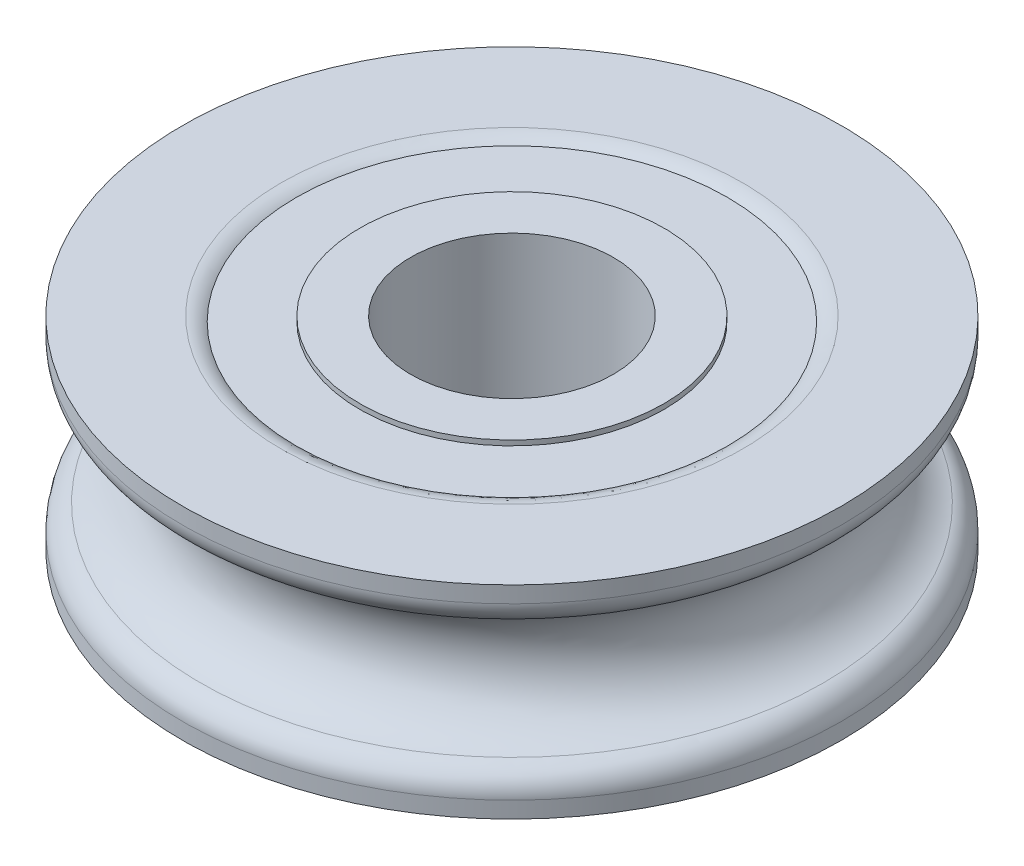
ISO-10303-21;
HEADER;
FILE_DESCRIPTION(('STEP AP214'),'2;1');
FILE_NAME('part.step','',(''),(''),'','','');
FILE_SCHEMA(('AUTOMOTIVE_DESIGN { 1 0 10303 214 1 1 1 1 }'));
ENDSEC;
DATA;
#1=APPLICATION_CONTEXT('core data for automotive mechanical design processes');
#2=APPLICATION_PROTOCOL_DEFINITION('international standard','automotive_design',2000,#1);
#3=PRODUCT_CONTEXT('',#1,'mechanical');
#4=PRODUCT('Part','Part','',(#3));
#5=PRODUCT_RELATED_PRODUCT_CATEGORY('part','',(#4));
#6=PRODUCT_DEFINITION_FORMATION('','',#4);
#7=PRODUCT_DEFINITION_CONTEXT('part definition',#1,'design');
#8=PRODUCT_DEFINITION('design','',#6,#7);
#9=PRODUCT_DEFINITION_SHAPE('','',#8);
#10=(LENGTH_UNIT() NAMED_UNIT(*) SI_UNIT(.MILLI.,.METRE.));
#11=(NAMED_UNIT(*) PLANE_ANGLE_UNIT() SI_UNIT($,.RADIAN.));
#12=(NAMED_UNIT(*) SI_UNIT($,.STERADIAN.) SOLID_ANGLE_UNIT());
#13=UNCERTAINTY_MEASURE_WITH_UNIT(LENGTH_MEASURE(1.E-05),#10,'distance_accuracy_value','');
#14=(GEOMETRIC_REPRESENTATION_CONTEXT(3) GLOBAL_UNCERTAINTY_ASSIGNED_CONTEXT((#13)) GLOBAL_UNIT_ASSIGNED_CONTEXT((#10,
#11,#12)) REPRESENTATION_CONTEXT('',''));
#15=CARTESIAN_POINT('',(0.,0.,0.));
#16=DIRECTION('',(0.,0.,1.));
#17=DIRECTION('',(1.,0.,0.));
#18=AXIS2_PLACEMENT_3D('',#15,#16,#17);
#19=CARTESIAN_POINT('',(0.,0.,0.));
#20=DIRECTION('',(0.,-1.,0.));
#21=DIRECTION('',(0.,0.,-1.));
#22=AXIS2_PLACEMENT_3D('',#19,#20,#21);
#23=TOROIDAL_SURFACE('',#22,6.5,1.25);
#24=CARTESIAN_POINT('',(0.,1.19789355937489,0.));
#25=DIRECTION('',(0.,1.,0.));
#26=DIRECTION('',(-1.,0.,0.));
#27=AXIS2_PLACEMENT_3D('',#24,#25,#26);
#28=CIRCLE('',#27,6.14285714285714);
#29=CARTESIAN_POINT('',(6.14285714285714,1.19789355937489,0.));
#30=VERTEX_POINT('',#29);
#31=EDGE_CURVE('E95',#30,#30,#28,.T.);
#32=ORIENTED_EDGE('',*,*,#31,.F.);
#33=EDGE_LOOP('',(#32));
#34=FACE_BOUND('',#33,.T.);
#35=CARTESIAN_POINT('',(0.,-1.19789355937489,0.));
#36=DIRECTION('',(0.,-1.,0.));
#37=DIRECTION('',(-1.,0.,0.));
#38=AXIS2_PLACEMENT_3D('',#35,#36,#37);
#39=CIRCLE('',#38,6.14285714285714);
#40=CARTESIAN_POINT('',(6.14285714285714,-1.19789355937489,0.));
#41=VERTEX_POINT('',#40);
#42=EDGE_CURVE('E51',#41,#41,#39,.T.);
#43=ORIENTED_EDGE('',*,*,#42,.F.);
#44=EDGE_LOOP('',(#43));
#45=FACE_BOUND('',#44,.T.);
#46=ADVANCED_FACE('F16',(#34,#45),#23,.F.);
#47=CARTESIAN_POINT('',(6.5,2.,0.));
#48=DIRECTION('',(0.,1.,0.));
#49=DIRECTION('',(0.,0.,1.));
#50=AXIS2_PLACEMENT_3D('',#47,#48,#49);
#51=PLANE('',#50);
#52=CARTESIAN_POINT('',(0.,2.,0.));
#53=DIRECTION('',(0.,-1.,0.));
#54=DIRECTION('',(1.,0.,0.));
#55=AXIS2_PLACEMENT_3D('',#52,#53,#54);
#56=CIRCLE('',#55,2.);
#57=CARTESIAN_POINT('',(2.,2.,0.));
#58=VERTEX_POINT('',#57);
#59=EDGE_CURVE('E10',#58,#58,#56,.T.);
#60=ORIENTED_EDGE('',*,*,#59,.T.);
#61=EDGE_LOOP('',(#60));
#62=FACE_BOUND('',#61,.T.);
#63=CARTESIAN_POINT('',(0.,2.,0.));
#64=DIRECTION('',(0.,1.,0.));
#65=DIRECTION('',(-1.,0.,0.));
#66=AXIS2_PLACEMENT_3D('',#63,#64,#65);
#67=CIRCLE('',#66,3.);
#68=CARTESIAN_POINT('',(3.,2.,0.));
#69=VERTEX_POINT('',#68);
#70=EDGE_CURVE('E27',#69,#69,#67,.T.);
#71=ORIENTED_EDGE('',*,*,#70,.T.);
#72=EDGE_LOOP('',(#71));
#73=FACE_BOUND('',#72,.T.);
#74=ADVANCED_FACE('F130',(#62,#73),#51,.T.);
#75=CARTESIAN_POINT('',(0.,1.,0.));
#76=DIRECTION('',(0.,1.,0.));
#77=DIRECTION('',(1.,0.,0.));
#78=AXIS2_PLACEMENT_3D('',#75,#76,#77);
#79=CYLINDRICAL_SURFACE('',#78,2.);
#80=ORIENTED_EDGE('',*,*,#59,.F.);
#81=EDGE_LOOP('',(#80));
#82=FACE_BOUND('',#81,.T.);
#83=CARTESIAN_POINT('',(0.,-2.,0.));
#84=DIRECTION('',(0.,-1.,0.));
#85=DIRECTION('',(1.,0.,0.));
#86=AXIS2_PLACEMENT_3D('',#83,#84,#85);
#87=CIRCLE('',#86,2.);
#88=CARTESIAN_POINT('',(2.,-2.,0.));
#89=VERTEX_POINT('',#88);
#90=EDGE_CURVE('E109',#89,#89,#87,.T.);
#91=ORIENTED_EDGE('',*,*,#90,.T.);
#92=EDGE_LOOP('',(#91));
#93=FACE_BOUND('',#92,.T.);
#94=ADVANCED_FACE('F119',(#82,#93),#79,.F.);
#95=CARTESIAN_POINT('',(0.,1.9,0.));
#96=DIRECTION('',(0.,1.,0.));
#97=DIRECTION('',(0.,0.,1.));
#98=AXIS2_PLACEMENT_3D('',#95,#96,#97);
#99=PLANE('',#98);
#100=CARTESIAN_POINT('',(0.,1.9,0.));
#101=DIRECTION('',(0.,-1.,0.));
#102=DIRECTION('',(-1.,0.,0.));
#103=AXIS2_PLACEMENT_3D('',#100,#101,#102);
#104=CIRCLE('',#103,4.25);
#105=CARTESIAN_POINT('',(-4.25,1.9,0.));
#106=VERTEX_POINT('',#105);
#107=EDGE_CURVE('E105',#106,#106,#104,.T.);
#108=ORIENTED_EDGE('',*,*,#107,.F.);
#109=EDGE_LOOP('',(#108));
#110=FACE_BOUND('',#109,.T.);
#111=CARTESIAN_POINT('',(0.,1.9,0.));
#112=DIRECTION('',(0.,1.,0.));
#113=DIRECTION('',(-1.,0.,0.));
#114=AXIS2_PLACEMENT_3D('',#111,#112,#113);
#115=CIRCLE('',#114,3.);
#116=CARTESIAN_POINT('',(3.,1.9,0.));
#117=VERTEX_POINT('',#116);
#118=EDGE_CURVE('E97',#117,#117,#115,.T.);
#119=ORIENTED_EDGE('',*,*,#118,.F.);
#120=EDGE_LOOP('',(#119));
#121=FACE_BOUND('',#120,.T.);
#122=ADVANCED_FACE('F117',(#110,#121),#99,.T.);
#123=CARTESIAN_POINT('',(0.,2.,0.));
#124=DIRECTION('',(0.,1.,0.));
#125=DIRECTION('',(-1.,0.,0.));
#126=AXIS2_PLACEMENT_3D('',#123,#124,#125);
#127=CYLINDRICAL_SURFACE('',#126,3.);
#128=ORIENTED_EDGE('',*,*,#70,.F.);
#129=EDGE_LOOP('',(#128));
#130=FACE_BOUND('',#129,.T.);
#131=ORIENTED_EDGE('',*,*,#118,.T.);
#132=EDGE_LOOP('',(#131));
#133=FACE_BOUND('',#132,.T.);
#134=ADVANCED_FACE('F18',(#130,#133),#127,.T.);
#135=CARTESIAN_POINT('',(6.5,2.,0.));
#136=DIRECTION('',(0.,1.,0.));
#137=DIRECTION('',(0.,0.,1.));
#138=AXIS2_PLACEMENT_3D('',#135,#136,#137);
#139=PLANE('',#138);
#140=CARTESIAN_POINT('',(0.,2.,0.));
#141=DIRECTION('',(0.,1.,0.));
#142=DIRECTION('',(1.,0.,0.));
#143=AXIS2_PLACEMENT_3D('',#140,#141,#142);
#144=CIRCLE('',#143,4.55);
#145=CARTESIAN_POINT('',(-4.55,2.,0.));
#146=VERTEX_POINT('',#145);
#147=EDGE_CURVE('E103',#146,#146,#144,.T.);
#148=ORIENTED_EDGE('',*,*,#147,.F.);
#149=EDGE_LOOP('',(#148));
#150=FACE_BOUND('',#149,.T.);
#151=CARTESIAN_POINT('',(0.,2.,0.));
#152=DIRECTION('',(0.,-1.,0.));
#153=DIRECTION('',(1.,0.,0.));
#154=AXIS2_PLACEMENT_3D('',#151,#152,#153);
#155=CIRCLE('',#154,6.5);
#156=CARTESIAN_POINT('',(6.5,2.,0.));
#157=VERTEX_POINT('',#156);
#158=EDGE_CURVE('E100',#157,#157,#155,.T.);
#159=ORIENTED_EDGE('',*,*,#158,.F.);
#160=EDGE_LOOP('',(#159));
#161=FACE_BOUND('',#160,.T.);
#162=ADVANCED_FACE('F128',(#150,#161),#139,.T.);
#163=CARTESIAN_POINT('',(0.,1.5,0.));
#164=DIRECTION('',(0.,1.,0.));
#165=DIRECTION('',(1.,0.,0.));
#166=AXIS2_PLACEMENT_3D('',#163,#164,#165);
#167=TOROIDAL_SURFACE('',#166,4.55,0.5);
#168=ORIENTED_EDGE('',*,*,#147,.T.);
#169=EDGE_LOOP('',(#168));
#170=FACE_BOUND('',#169,.T.);
#171=ORIENTED_EDGE('',*,*,#107,.T.);
#172=EDGE_LOOP('',(#171));
#173=FACE_BOUND('',#172,.T.);
#174=ADVANCED_FACE('F152',(#170,#173),#167,.T.);
#175=CARTESIAN_POINT('',(6.5,-2.,0.));
#176=DIRECTION('',(0.,1.,0.));
#177=DIRECTION('',(0.,0.,1.));
#178=AXIS2_PLACEMENT_3D('',#175,#176,#177);
#179=PLANE('',#178);
#180=ORIENTED_EDGE('',*,*,#90,.F.);
#181=EDGE_LOOP('',(#180));
#182=FACE_BOUND('',#181,.T.);
#183=CARTESIAN_POINT('',(0.,-2.,0.));
#184=DIRECTION('',(0.,-1.,0.));
#185=DIRECTION('',(-1.,0.,0.));
#186=AXIS2_PLACEMENT_3D('',#183,#184,#185);
#187=CIRCLE('',#186,3.);
#188=CARTESIAN_POINT('',(3.,-2.,0.));
#189=VERTEX_POINT('',#188);
#190=EDGE_CURVE('E99',#189,#189,#187,.T.);
#191=ORIENTED_EDGE('',*,*,#190,.T.);
#192=EDGE_LOOP('',(#191));
#193=FACE_BOUND('',#192,.T.);
#194=ADVANCED_FACE('F149',(#182,#193),#179,.F.);
#195=CARTESIAN_POINT('',(0.,-1.9,0.));
#196=DIRECTION('',(0.,1.,0.));
#197=DIRECTION('',(0.,0.,1.));
#198=AXIS2_PLACEMENT_3D('',#195,#196,#197);
#199=PLANE('',#198);
#200=CARTESIAN_POINT('',(0.,-1.9,0.));
#201=DIRECTION('',(0.,-1.,0.));
#202=DIRECTION('',(-1.,0.,0.));
#203=AXIS2_PLACEMENT_3D('',#200,#201,#202);
#204=CIRCLE('',#203,4.25);
#205=CARTESIAN_POINT('',(4.25,-1.9,0.));
#206=VERTEX_POINT('',#205);
#207=EDGE_CURVE('E84',#206,#206,#204,.T.);
#208=ORIENTED_EDGE('',*,*,#207,.T.);
#209=EDGE_LOOP('',(#208));
#210=FACE_BOUND('',#209,.T.);
#211=CARTESIAN_POINT('',(0.,-1.9,0.));
#212=DIRECTION('',(0.,1.,0.));
#213=DIRECTION('',(-1.,0.,0.));
#214=AXIS2_PLACEMENT_3D('',#211,#212,#213);
#215=CIRCLE('',#214,3.);
#216=CARTESIAN_POINT('',(3.,-1.9,0.));
#217=VERTEX_POINT('',#216);
#218=EDGE_CURVE('E89',#217,#217,#215,.T.);
#219=ORIENTED_EDGE('',*,*,#218,.T.);
#220=EDGE_LOOP('',(#219));
#221=FACE_BOUND('',#220,.T.);
#222=ADVANCED_FACE('F85',(#210,#221),#199,.F.);
#223=CARTESIAN_POINT('',(0.,-2.,0.));
#224=DIRECTION('',(0.,1.,0.));
#225=DIRECTION('',(-1.,0.,0.));
#226=AXIS2_PLACEMENT_3D('',#223,#224,#225);
#227=CYLINDRICAL_SURFACE('',#226,3.);
#228=ORIENTED_EDGE('',*,*,#190,.F.);
#229=EDGE_LOOP('',(#228));
#230=FACE_BOUND('',#229,.T.);
#231=ORIENTED_EDGE('',*,*,#218,.F.);
#232=EDGE_LOOP('',(#231));
#233=FACE_BOUND('',#232,.T.);
#234=ADVANCED_FACE('F170',(#230,#233),#227,.T.);
#235=CARTESIAN_POINT('',(6.5,-2.,0.));
#236=DIRECTION('',(0.,1.,0.));
#237=DIRECTION('',(0.,0.,1.));
#238=AXIS2_PLACEMENT_3D('',#235,#236,#237);
#239=PLANE('',#238);
#240=CARTESIAN_POINT('',(0.,-2.,0.));
#241=DIRECTION('',(0.,-1.,0.));
#242=DIRECTION('',(1.,0.,0.));
#243=AXIS2_PLACEMENT_3D('',#240,#241,#242);
#244=CIRCLE('',#243,4.55);
#245=CARTESIAN_POINT('',(-4.55,-2.,0.));
#246=VERTEX_POINT('',#245);
#247=EDGE_CURVE('E80',#246,#246,#244,.T.);
#248=ORIENTED_EDGE('',*,*,#247,.F.);
#249=EDGE_LOOP('',(#248));
#250=FACE_BOUND('',#249,.T.);
#251=CARTESIAN_POINT('',(0.,-2.,0.));
#252=DIRECTION('',(0.,-1.,0.));
#253=DIRECTION('',(1.,0.,0.));
#254=AXIS2_PLACEMENT_3D('',#251,#252,#253);
#255=CIRCLE('',#254,6.5);
#256=CARTESIAN_POINT('',(6.5,-2.,0.));
#257=VERTEX_POINT('',#256);
#258=EDGE_CURVE('E20',#257,#257,#255,.T.);
#259=ORIENTED_EDGE('',*,*,#258,.T.);
#260=EDGE_LOOP('',(#259));
#261=FACE_BOUND('',#260,.T.);
#262=ADVANCED_FACE('F167',(#250,#261),#239,.F.);
#263=CARTESIAN_POINT('',(0.,-1.5,0.));
#264=DIRECTION('',(0.,-1.,0.));
#265=DIRECTION('',(1.,0.,0.));
#266=AXIS2_PLACEMENT_3D('',#263,#264,#265);
#267=TOROIDAL_SURFACE('',#266,4.55,0.5);
#268=ORIENTED_EDGE('',*,*,#247,.T.);
#269=EDGE_LOOP('',(#268));
#270=FACE_BOUND('',#269,.T.);
#271=ORIENTED_EDGE('',*,*,#207,.F.);
#272=EDGE_LOOP('',(#271));
#273=FACE_BOUND('',#272,.T.);
#274=ADVANCED_FACE('F156',(#270,#273),#267,.T.);
#275=CARTESIAN_POINT('',(0.,-1.625,0.));
#276=DIRECTION('',(0.,1.,0.));
#277=DIRECTION('',(1.,0.,0.));
#278=AXIS2_PLACEMENT_3D('',#275,#276,#277);
#279=CYLINDRICAL_SURFACE('',#278,6.5);
#280=CARTESIAN_POINT('',(0.,-1.67705098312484,0.));
#281=DIRECTION('',(0.,1.,0.));
#282=DIRECTION('',(-1.,0.,0.));
#283=AXIS2_PLACEMENT_3D('',#280,#281,#282);
#284=CIRCLE('',#283,6.5);
#285=CARTESIAN_POINT('',(6.5,-1.67705098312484,0.));
#286=VERTEX_POINT('',#285);
#287=EDGE_CURVE('E43',#286,#286,#284,.T.);
#288=ORIENTED_EDGE('',*,*,#287,.F.);
#289=EDGE_LOOP('',(#288));
#290=FACE_BOUND('',#289,.T.);
#291=ORIENTED_EDGE('',*,*,#258,.F.);
#292=EDGE_LOOP('',(#291));
#293=FACE_BOUND('',#292,.T.);
#294=ADVANCED_FACE('F154',(#290,#293),#279,.T.);
#295=CARTESIAN_POINT('',(0.,-1.67705098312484,0.));
#296=DIRECTION('',(0.,-1.,0.));
#297=DIRECTION('',(0.,0.,-1.));
#298=AXIS2_PLACEMENT_3D('',#295,#296,#297);
#299=TOROIDAL_SURFACE('',#298,6.,0.5);
#300=ORIENTED_EDGE('',*,*,#287,.T.);
#301=EDGE_LOOP('',(#300));
#302=FACE_BOUND('',#301,.T.);
#303=ORIENTED_EDGE('',*,*,#42,.T.);
#304=EDGE_LOOP('',(#303));
#305=FACE_BOUND('',#304,.T.);
#306=ADVANCED_FACE('F147',(#302,#305),#299,.T.);
#307=CARTESIAN_POINT('',(0.,1.625,0.));
#308=DIRECTION('',(0.,1.,0.));
#309=DIRECTION('',(1.,0.,0.));
#310=AXIS2_PLACEMENT_3D('',#307,#308,#309);
#311=CYLINDRICAL_SURFACE('',#310,6.5);
#312=CARTESIAN_POINT('',(0.,1.67705098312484,0.));
#313=DIRECTION('',(0.,-1.,0.));
#314=DIRECTION('',(-1.,0.,0.));
#315=AXIS2_PLACEMENT_3D('',#312,#313,#314);
#316=CIRCLE('',#315,6.5);
#317=CARTESIAN_POINT('',(6.5,1.67705098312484,0.));
#318=VERTEX_POINT('',#317);
#319=EDGE_CURVE('E93',#318,#318,#316,.T.);
#320=ORIENTED_EDGE('',*,*,#319,.F.);
#321=EDGE_LOOP('',(#320));
#322=FACE_BOUND('',#321,.T.);
#323=ORIENTED_EDGE('',*,*,#158,.T.);
#324=EDGE_LOOP('',(#323));
#325=FACE_BOUND('',#324,.T.);
#326=ADVANCED_FACE('F162',(#322,#325),#311,.T.);
#327=CARTESIAN_POINT('',(0.,1.67705098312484,0.));
#328=DIRECTION('',(0.,-1.,0.));
#329=DIRECTION('',(0.,0.,-1.));
#330=AXIS2_PLACEMENT_3D('',#327,#328,#329);
#331=TOROIDAL_SURFACE('',#330,6.,0.5);
#332=ORIENTED_EDGE('',*,*,#31,.T.);
#333=EDGE_LOOP('',(#332));
#334=FACE_BOUND('',#333,.T.);
#335=ORIENTED_EDGE('',*,*,#319,.T.);
#336=EDGE_LOOP('',(#335));
#337=FACE_BOUND('',#336,.T.);
#338=ADVANCED_FACE('F159',(#334,#337),#331,.T.);
#339=CLOSED_SHELL('',(#46,#74,#94,#122,#134,#162,#174,#194,#222,#234,#262,#274,#294,#306,#326,#338));
#340=MANIFOLD_SOLID_BREP('B1',#339);
#341=ADVANCED_BREP_SHAPE_REPRESENTATION('',(#18,#340),#14);
#342=SHAPE_DEFINITION_REPRESENTATION(#9,#341);
ENDSEC;
END-ISO-10303-21;
